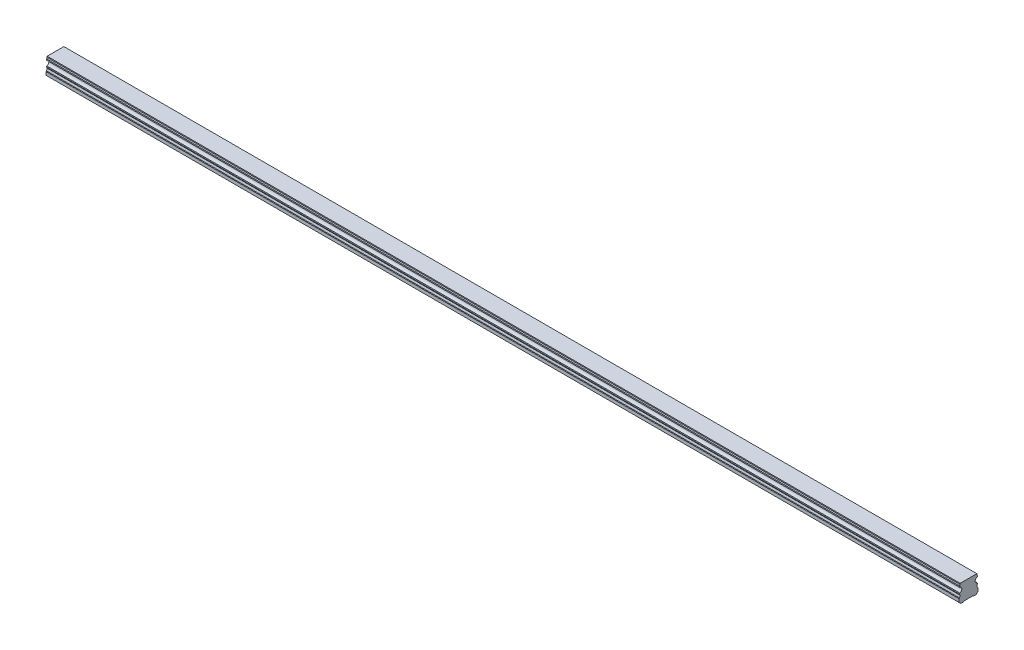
from build123d import *

# Parameters (mm, degrees)
BOSS_EXTRUDE1_DEPTH        = 720
SKETCH3_R                  = 2.5
SKETCH3_R_2                = 2.1
CUT_EXTRUDE3_DEPTH         = 7
SKETCH3_2_R                = 2.1
CUT_EXTRUDE4_DEPTH         = 9.5
CHAMFER1_SIZE              = 0.4
LPATTERN2_COUNT            = 12
LPATTERN2_PITCH            = 60
CHAMFER1_OF_LPATTERN2_SIZE = 0.4


with BuildPart() as part:
    # Sketch1 → Boss-Extrude1 (new body)
    with BuildSketch(Plane(origin=(0, 0, 0), x_dir=(0, 0, -1), z_dir=(1, 0, 0))):
        with BuildLine():
            Line((6.59, 14), (-6.59, 14))
            Line((-6.59, 14), (-6.59, 13.15))
            Line((-6.59, 13.15), (-6.96, 12.356532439))
            Line((-6.96, 12.356532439), (-6.96, 11.435174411))
            ThreePointArc((-6.96, 11.435174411), (-5.25, 9.5), (-6.96, 7.564825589))
            Line((-6.96, 7.564825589), (-6.96, 6.643467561))
            Line((-6.96, 6.643467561), (-6.59, 5.85))
            Line((-6.59, 5.85), (-7.032116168, 4.2))
            Line((-7.032116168, 4.2), (-7.5, 3.929867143))
            Line((-7.5, 3.929867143), (-7.5, 1.4))
            Line((-7.5, 1.4), (-6.1, 0))
            Line((-6.1, 0), (-3.65, 0))
            Line((-3.65, 0), (-3.25, 0.4))
            Line((-3.25, 0.4), (3.25, 0.4))
            Line((3.25, 0.4), (3.65, 0))
            Line((3.65, 0), (6.1, 0))
            Line((6.1, 0), (7.5, 1.4))
            Line((7.5, 1.4), (7.5, 3.929867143))
            Line((7.5, 3.929867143), (7.032116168, 4.2))
            Line((7.032116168, 4.2), (6.59, 5.85))
            Line((6.59, 5.85), (6.96, 6.643467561))
            Line((6.96, 6.643467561), (6.96, 7.564825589))
            ThreePointArc((6.96, 7.564825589), (5.25, 9.5), (6.96, 11.435174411))
            Line((6.96, 11.435174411), (6.96, 12.356532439))
            Line((6.96, 12.356532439), (6.59, 13.15))
            Line((6.59, 13.15), (6.59, 14))
        make_face()
    extrude(amount=BOSS_EXTRUDE1_DEPTH)

    # Sketch3 → Cut-Extrude3 (cut)
    with BuildSketch(Plane.XZ):
        with Locations(Location((30, 0, 0), (0, 0, 270))):
            Circle(SKETCH3_R)
        with Locations(Location((30, 0, 0), (0, 0, 270))):
            Circle(SKETCH3_R_2, mode=Mode.SUBTRACT)
    cut_extrude3 = extrude(amount=-CUT_EXTRUDE3_DEPTH, mode=Mode.SUBTRACT)

    # Sketch3_2 → Cut-Extrude4 (cut)
    with BuildSketch(Plane.XZ):
        with Locations(Location((30, 0, 0), (0, 0, 270))):
            Circle(SKETCH3_2_R)
    cut_extrude4 = extrude(amount=-CUT_EXTRUDE4_DEPTH, mode=Mode.SUBTRACT)

    # Cut-Extrude5 cone 1 section (on through the dimple's axis) → Cut-Extrude5 (revolve, cut)
    with BuildSketch(Plane(origin=(30, 9.5, 0), x_dir=(0, 0, -1), z_dir=(1, 0, 0))):
        Polygon((0, 0), (2.1, 0), (0, 1.212435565), align=None)
    revolve(axis=Axis((30, 9.5, 0), (0, 1, 0)), mode=Mode.SUBTRACT)

    # Chamfer1
    chamfer1_edges = [part.edges().sort_by_distance(p)[0] for p in [
        (30, 0.4, 2.5),
    ]]
    chamfer(chamfer1_edges, length=CHAMFER1_SIZE)

    # LPattern2: Cut-Extrude3, Cut-Extrude4 ×12
    with Locations(*[(i * LPATTERN2_PITCH, 0, 0) for i in range(1, LPATTERN2_COUNT)]):
        add(cut_extrude3, mode=Mode.SUBTRACT)
        add(cut_extrude4, mode=Mode.SUBTRACT)

    # Chamfer1 of LPattern2
    chamfer1_of_lpattern2_edges = [part.edges().sort_by_distance(p)[0] for p in [
        (90, 0.4, 2.5),
        (150, 0.4, 2.5),
        (210, 0.4, 2.5),
        (270, 0.4, 2.5),
        (330, 0.4, 2.5),
        (390, 0.4, 2.5),
        (450, 0.4, 2.5),
        (510, 0.4, 2.5),
        (570, 0.4, 2.5),
        (630, 0.4, 2.5),
        (690, 0.4, 2.5),
    ]]
    chamfer(chamfer1_of_lpattern2_edges, length=CHAMFER1_OF_LPATTERN2_SIZE)


solid = part.part
